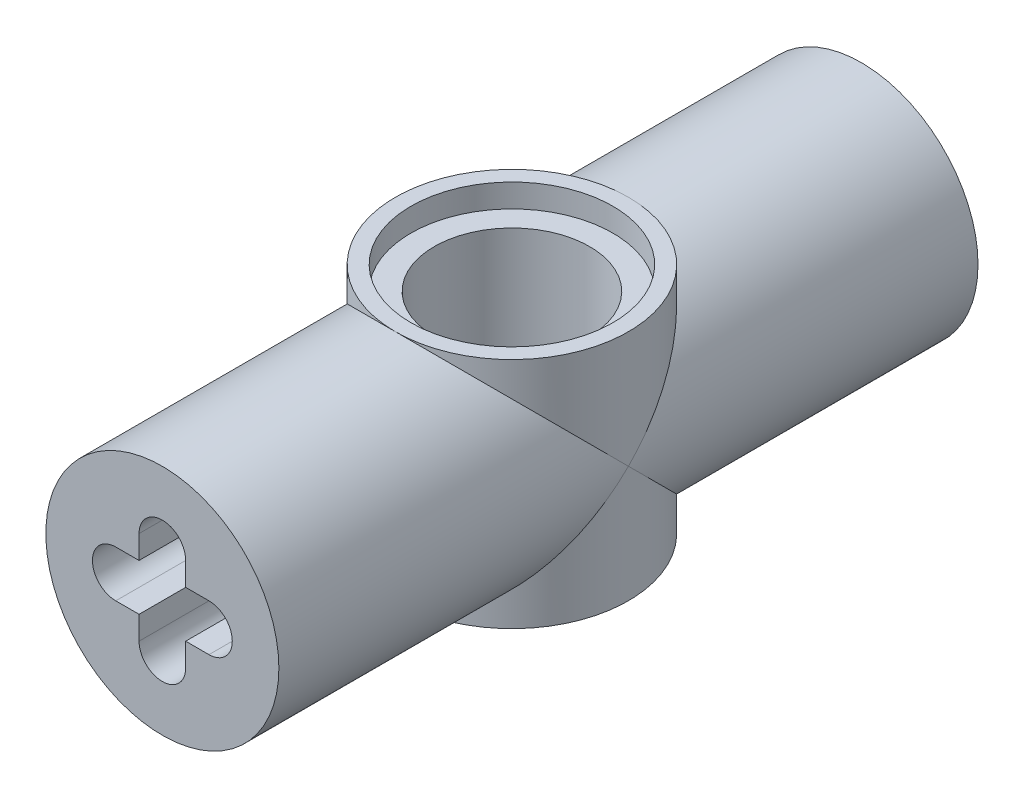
from build123d import *

# Parameters (mm, degrees)
SKETCH1_R                = 3.81
BOSS_EXTRUDE1_DEPTH      = 22.86
BOSS_EXTRUDE2_DEPTH      = 3.81
BOSS_EXTRUDE2_DEPTH_BACK = 3.81
SKETCH2_R                = 3.81
SKETCH4_R                = 2.54
CUT_EXTRUDE1_DEPTH       = 25.679861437
SKETCH5_R                = 3.302
CUT_EXTRUDE2_DEPTH       = 0.762
CUT_EXTRUDE3_START       = -0.762
SKETCH6_R                = 3.302
CUT_EXTRUDE3_DEPTH       = 0.762


with BuildPart() as part:
    # Sketch1 → Boss-Extrude1 (new body)
    with BuildSketch(Plane.XY):
        with Locations((1.524, 0)):
            Circle(SKETCH1_R)
        with BuildLine():
            ThreePointArc((0, -0.762), (-0.762, 0), (0, 0.762))
            Line((0, 0.762), (0.762, 0.762))
            Line((0.762, 0.762), (0.762, 1.524))
            ThreePointArc((0.762, 1.524), (1.524, 2.286), (2.286, 1.524))
            Line((2.286, 1.524), (2.286, 0.762))
            Line((2.286, 0.762), (3.048, 0.762))
            ThreePointArc((3.048, 0.762), (3.81, 0), (3.048, -0.762))
            Line((3.048, -0.762), (2.286, -0.762))
            Line((2.286, -0.762), (2.286, -1.524))
            ThreePointArc((2.286, -1.524), (1.524, -2.286), (0.762, -1.524))
            Line((0.762, -1.524), (0.762, -0.762))
            Line((0.762, -0.762), (0, -0.762))
        make_face(mode=Mode.SUBTRACT)
    extrude(amount=BOSS_EXTRUDE1_DEPTH)

    # Sketch2 → Boss-Extrude2 (add, two sides: drawn at the far end of the back side and taken through both)
    with BuildSketch(Plane(origin=(0, 0, 0), x_dir=(1, 0, 0), z_dir=(0, 1, 0)).offset(-BOSS_EXTRUDE2_DEPTH_BACK)):
        with Locations((1.524, -11.43)):
            Circle(SKETCH2_R)
    extrude(amount=BOSS_EXTRUDE2_DEPTH + BOSS_EXTRUDE2_DEPTH_BACK)

    # Sketch4 → Cut-Extrude1 (cut, through all)
    with BuildSketch(Plane(origin=(0, 3.81, 0), x_dir=(-1, 0, 0), z_dir=(0, 1, 0))):
        with Locations(Location((-1.524, 11.43, 0), (0, 0, 90))):
            Circle(SKETCH4_R)
    extrude(amount=-CUT_EXTRUDE1_DEPTH, mode=Mode.SUBTRACT)

    # Sketch5 → Cut-Extrude2 (cut)
    with BuildSketch(Plane(origin=(0, 3.81, 0), x_dir=(1, 0, 0), z_dir=(0, 1, 0))):
        with Locations(Location((1.524, -11.43, 0), (0, 0, 270))):
            Circle(SKETCH5_R)
    extrude(amount=-CUT_EXTRUDE2_DEPTH, mode=Mode.SUBTRACT)

    # Sketch6 → Cut-Extrude3 (cut)
    with BuildSketch(Plane.XZ.offset(3.81).offset(CUT_EXTRUDE3_START)):
        with Locations(Location((1.524, 11.43, 0), (0, 0, 90))):
            Circle(SKETCH6_R)
    extrude(amount=CUT_EXTRUDE3_DEPTH, mode=Mode.SUBTRACT)


solid = part.part
